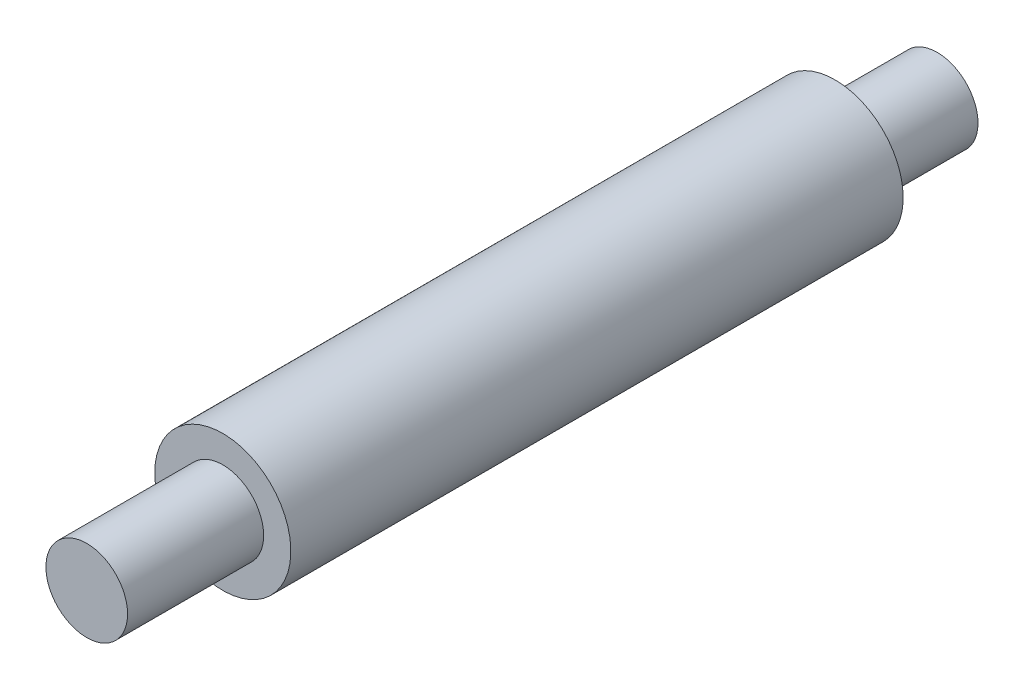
from build123d import *

# Parameters (mm, degrees)
SKETCH_1_R      = 10
EXTRUDE_2_DEPTH = 90
SKETCH_4_R      = 6
EXTRUDE_3_DEPTH = 20
EXTRUDE_START   = 15
SKETCH_5_R      = 6
EXTRUDE_4_DEPTH = 15


with BuildPart() as part:
    # Sketch 1 → Extrude 2 (new body)
    with BuildSketch(Plane.XY):
        with Locations(Location((0, 0, 0), (0, 0, 180))):
            Circle(SKETCH_1_R)
    extrude(amount=EXTRUDE_2_DEPTH)

    # Sketch 4 → Extrude 3 (add)
    with BuildSketch(Plane.XY.offset(90)):
        Circle(SKETCH_4_R)
    extrude(amount=EXTRUDE_3_DEPTH)

    # Sketch 5 → Extrude 4 (add)
    with BuildSketch(Plane(origin=(0, 0, 0), x_dir=(-1, 0, 0), z_dir=(0, 0, -1)).offset(EXTRUDE_START)):
        with Locations(Location((0, 0, 0), (0, 0, 180))):
            Circle(SKETCH_5_R)
    extrude(amount=-EXTRUDE_4_DEPTH)


solid = part.part
